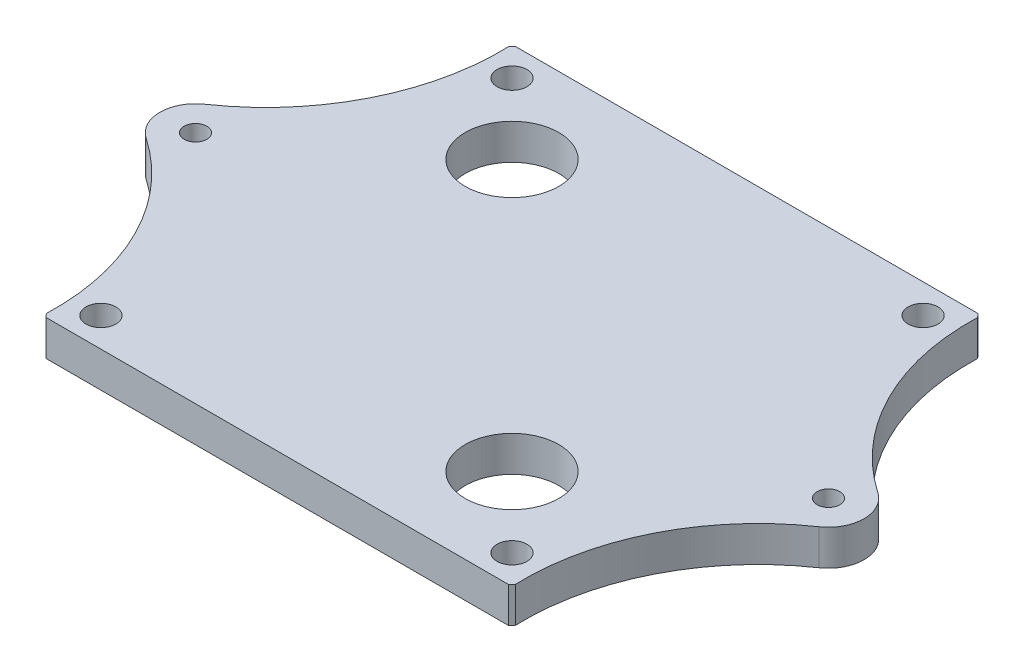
ISO-10303-21;
HEADER;
FILE_DESCRIPTION(('STEP AP214'),'2;1');
FILE_NAME('part.step','',(''),(''),'','','');
FILE_SCHEMA(('AUTOMOTIVE_DESIGN { 1 0 10303 214 1 1 1 1 }'));
ENDSEC;
DATA;
#1=APPLICATION_CONTEXT('core data for automotive mechanical design processes');
#2=APPLICATION_PROTOCOL_DEFINITION('international standard','automotive_design',2000,#1);
#3=PRODUCT_CONTEXT('',#1,'mechanical');
#4=PRODUCT('Part','Part','',(#3));
#5=PRODUCT_RELATED_PRODUCT_CATEGORY('part','',(#4));
#6=PRODUCT_DEFINITION_FORMATION('','',#4);
#7=PRODUCT_DEFINITION_CONTEXT('part definition',#1,'design');
#8=PRODUCT_DEFINITION('design','',#6,#7);
#9=PRODUCT_DEFINITION_SHAPE('','',#8);
#10=(LENGTH_UNIT() NAMED_UNIT(*) SI_UNIT(.MILLI.,.METRE.));
#11=(NAMED_UNIT(*) PLANE_ANGLE_UNIT() SI_UNIT($,.RADIAN.));
#12=(NAMED_UNIT(*) SI_UNIT($,.STERADIAN.) SOLID_ANGLE_UNIT());
#13=UNCERTAINTY_MEASURE_WITH_UNIT(LENGTH_MEASURE(1.E-05),#10,'distance_accuracy_value','');
#14=(GEOMETRIC_REPRESENTATION_CONTEXT(3) GLOBAL_UNCERTAINTY_ASSIGNED_CONTEXT((#13)) GLOBAL_UNIT_ASSIGNED_CONTEXT((#10,
#11,#12)) REPRESENTATION_CONTEXT('',''));
#15=CARTESIAN_POINT('',(0.,0.,0.));
#16=DIRECTION('',(0.,0.,1.));
#17=DIRECTION('',(1.,0.,0.));
#18=AXIS2_PLACEMENT_3D('',#15,#16,#17);
#19=CARTESIAN_POINT('',(-65.959263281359,5.,-31.3608038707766));
#20=DIRECTION('',(0.,-1.,0.));
#21=DIRECTION('',(0.,0.,-1.));
#22=AXIS2_PLACEMENT_3D('',#19,#20,#21);
#23=CYLINDRICAL_SURFACE('',#22,33.);
#24=CARTESIAN_POINT('',(-65.959263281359,5.,-31.3608038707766));
#25=DIRECTION('',(0.,-1.,0.));
#26=DIRECTION('',(0.,0.,1.));
#27=AXIS2_PLACEMENT_3D('',#24,#25,#26);
#28=CIRCLE('',#27,33.);
#29=CARTESIAN_POINT('',(-32.9796417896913,5.,-32.5203582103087));
#30=VERTEX_POINT('',#29);
#31=CARTESIAN_POINT('',(-47.323587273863,5.,-4.12642156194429));
#32=VERTEX_POINT('',#31);
#33=EDGE_CURVE('E237',#30,#32,#28,.T.);
#34=ORIENTED_EDGE('',*,*,#33,.F.);
#35=DIRECTION('',(0.,-1.,0.));
#36=VECTOR('',#35,1.);
#37=CARTESIAN_POINT('',(-32.9796417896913,5.,-32.5203582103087));
#38=LINE('',#37,#36);
#39=CARTESIAN_POINT('',(-32.9796417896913,0.,-32.5203582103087));
#40=VERTEX_POINT('',#39);
#41=EDGE_CURVE('E126',#30,#40,#38,.T.);
#42=ORIENTED_EDGE('',*,*,#41,.T.);
#43=CARTESIAN_POINT('',(-65.959263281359,0.,-31.3608038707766));
#44=DIRECTION('',(0.,-1.,0.));
#45=DIRECTION('',(0.,0.,1.));
#46=AXIS2_PLACEMENT_3D('',#43,#44,#45);
#47=CIRCLE('',#46,33.);
#48=CARTESIAN_POINT('',(-47.323587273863,0.,-4.12642156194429));
#49=VERTEX_POINT('',#48);
#50=EDGE_CURVE('E120',#40,#49,#47,.T.);
#51=ORIENTED_EDGE('',*,*,#50,.T.);
#52=DIRECTION('',(0.,-1.,0.));
#53=VECTOR('',#52,1.);
#54=CARTESIAN_POINT('',(-47.323587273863,5.,-4.12642156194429));
#55=LINE('',#54,#53);
#56=EDGE_CURVE('E124',#32,#49,#55,.T.);
#57=ORIENTED_EDGE('',*,*,#56,.F.);
#58=EDGE_LOOP('',(#34,#42,#51,#57));
#59=FACE_BOUND('',#58,.T.);
#60=ADVANCED_FACE('F27',(#59),#23,.F.);
#61=CARTESIAN_POINT('',(-44.5,5.,0.));
#62=DIRECTION('',(0.,-1.,0.));
#63=DIRECTION('',(0.,0.,-1.));
#64=AXIS2_PLACEMENT_3D('',#61,#62,#63);
#65=CYLINDRICAL_SURFACE('',#64,4.99999999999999);
#66=CARTESIAN_POINT('',(-44.5,0.,0.));
#67=DIRECTION('',(0.,1.,0.));
#68=DIRECTION('',(0.,0.,1.));
#69=AXIS2_PLACEMENT_3D('',#66,#67,#68);
#70=CIRCLE('',#69,4.99999999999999);
#71=CARTESIAN_POINT('',(-47.323587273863,0.,4.1264215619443));
#72=VERTEX_POINT('',#71);
#73=EDGE_CURVE('E128',#49,#72,#70,.T.);
#74=ORIENTED_EDGE('',*,*,#73,.T.);
#75=DIRECTION('',(0.,-1.,0.));
#76=VECTOR('',#75,1.);
#77=CARTESIAN_POINT('',(-47.323587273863,5.,4.1264215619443));
#78=LINE('',#77,#76);
#79=CARTESIAN_POINT('',(-47.323587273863,5.,4.1264215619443));
#80=VERTEX_POINT('',#79);
#81=EDGE_CURVE('E142',#80,#72,#78,.T.);
#82=ORIENTED_EDGE('',*,*,#81,.F.);
#83=CARTESIAN_POINT('',(-44.5,5.,0.));
#84=DIRECTION('',(0.,1.,0.));
#85=DIRECTION('',(0.,0.,1.));
#86=AXIS2_PLACEMENT_3D('',#83,#84,#85);
#87=CIRCLE('',#86,4.99999999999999);
#88=EDGE_CURVE('E141',#32,#80,#87,.T.);
#89=ORIENTED_EDGE('',*,*,#88,.F.);
#90=ORIENTED_EDGE('',*,*,#56,.T.);
#91=EDGE_LOOP('',(#74,#82,#89,#90));
#92=FACE_BOUND('',#91,.T.);
#93=ADVANCED_FACE('F140',(#92),#65,.T.);
#94=CARTESIAN_POINT('',(-65.959263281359,5.,31.3608038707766));
#95=DIRECTION('',(0.,-1.,0.));
#96=DIRECTION('',(0.,0.,-1.));
#97=AXIS2_PLACEMENT_3D('',#94,#95,#96);
#98=CYLINDRICAL_SURFACE('',#97,33.);
#99=CARTESIAN_POINT('',(-65.959263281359,0.,31.3608038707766));
#100=DIRECTION('',(0.,-1.,0.));
#101=DIRECTION('',(0.,0.,1.));
#102=AXIS2_PLACEMENT_3D('',#99,#100,#101);
#103=CIRCLE('',#102,33.);
#104=CARTESIAN_POINT('',(-32.978814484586,0.,32.4965842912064));
#105=VERTEX_POINT('',#104);
#106=EDGE_CURVE('E134',#72,#105,#103,.T.);
#107=ORIENTED_EDGE('',*,*,#106,.T.);
#108=DIRECTION('',(0.,-1.,0.));
#109=VECTOR('',#108,1.);
#110=CARTESIAN_POINT('',(-32.978814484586,5.,32.4965842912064));
#111=LINE('',#110,#109);
#112=CARTESIAN_POINT('',(-32.978814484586,5.,32.4965842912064));
#113=VERTEX_POINT('',#112);
#114=EDGE_CURVE('E11',#105,#113,#111,.F.);
#115=ORIENTED_EDGE('',*,*,#114,.T.);
#116=CARTESIAN_POINT('',(-65.959263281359,5.,31.3608038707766));
#117=DIRECTION('',(0.,-1.,0.));
#118=DIRECTION('',(0.,0.,1.));
#119=AXIS2_PLACEMENT_3D('',#116,#117,#118);
#120=CIRCLE('',#119,33.);
#121=EDGE_CURVE('E240',#80,#113,#120,.T.);
#122=ORIENTED_EDGE('',*,*,#121,.F.);
#123=ORIENTED_EDGE('',*,*,#81,.T.);
#124=EDGE_LOOP('',(#107,#115,#122,#123));
#125=FACE_BOUND('',#124,.T.);
#126=ADVANCED_FACE('F283',(#125),#98,.F.);
#127=CARTESIAN_POINT('',(-33.,5.,33.));
#128=DIRECTION('',(0.,0.,-1.));
#129=DIRECTION('',(-1.,0.,0.));
#130=AXIS2_PLACEMENT_3D('',#127,#128,#129);
#131=PLANE('',#130);
#132=DIRECTION('',(1.,0.,0.));
#133=VECTOR('',#132,1.);
#134=CARTESIAN_POINT('',(-33.,0.,33.));
#135=LINE('',#134,#133);
#136=CARTESIAN_POINT('',(-32.523100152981,0.,33.));
#137=VERTEX_POINT('',#136);
#138=CARTESIAN_POINT('',(32.5,0.,33.));
#139=VERTEX_POINT('',#138);
#140=EDGE_CURVE('E225',#137,#139,#135,.T.);
#141=ORIENTED_EDGE('',*,*,#140,.T.);
#142=DIRECTION('',(0.,1.,0.));
#143=VECTOR('',#142,1.);
#144=CARTESIAN_POINT('',(32.5,5.,33.));
#145=LINE('',#144,#143);
#146=CARTESIAN_POINT('',(32.5,5.,33.));
#147=VERTEX_POINT('',#146);
#148=EDGE_CURVE('E35',#139,#147,#145,.T.);
#149=ORIENTED_EDGE('',*,*,#148,.T.);
#150=DIRECTION('',(1.,0.,0.));
#151=VECTOR('',#150,1.);
#152=CARTESIAN_POINT('',(-33.,5.,33.));
#153=LINE('',#152,#151);
#154=CARTESIAN_POINT('',(-32.523100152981,5.,33.));
#155=VERTEX_POINT('',#154);
#156=EDGE_CURVE('E243',#155,#147,#153,.T.);
#157=ORIENTED_EDGE('',*,*,#156,.F.);
#158=DIRECTION('',(0.,-1.,0.));
#159=VECTOR('',#158,1.);
#160=CARTESIAN_POINT('',(-32.523100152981,5.,33.));
#161=LINE('',#160,#159);
#162=EDGE_CURVE('E173',#155,#137,#161,.T.);
#163=ORIENTED_EDGE('',*,*,#162,.T.);
#164=EDGE_LOOP('',(#141,#149,#157,#163));
#165=FACE_BOUND('',#164,.T.);
#166=ADVANCED_FACE('F290',(#165),#131,.F.);
#167=CARTESIAN_POINT('',(65.959263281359,5.,31.3608038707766));
#168=DIRECTION('',(0.,-1.,0.));
#169=DIRECTION('',(0.,0.,-1.));
#170=AXIS2_PLACEMENT_3D('',#167,#168,#169);
#171=CYLINDRICAL_SURFACE('',#170,33.);
#172=CARTESIAN_POINT('',(65.959263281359,5.,31.3608038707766));
#173=DIRECTION('',(0.,-1.,0.));
#174=DIRECTION('',(0.,0.,-1.));
#175=AXIS2_PLACEMENT_3D('',#172,#173,#174);
#176=CIRCLE('',#175,33.);
#177=CARTESIAN_POINT('',(32.9796417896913,5.,32.5203582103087));
#178=VERTEX_POINT('',#177);
#179=CARTESIAN_POINT('',(47.323587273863,5.,4.12642156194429));
#180=VERTEX_POINT('',#179);
#181=EDGE_CURVE('E245',#178,#180,#176,.T.);
#182=ORIENTED_EDGE('',*,*,#181,.F.);
#183=DIRECTION('',(0.,-1.,0.));
#184=VECTOR('',#183,1.);
#185=CARTESIAN_POINT('',(32.9796417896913,5.,32.5203582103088));
#186=LINE('',#185,#184);
#187=CARTESIAN_POINT('',(32.9796417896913,0.,32.5203582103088));
#188=VERTEX_POINT('',#187);
#189=EDGE_CURVE('E170',#178,#188,#186,.T.);
#190=ORIENTED_EDGE('',*,*,#189,.T.);
#191=CARTESIAN_POINT('',(65.959263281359,0.,31.3608038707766));
#192=DIRECTION('',(0.,-1.,0.));
#193=DIRECTION('',(0.,0.,-1.));
#194=AXIS2_PLACEMENT_3D('',#191,#192,#193);
#195=CIRCLE('',#194,33.);
#196=CARTESIAN_POINT('',(47.323587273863,0.,4.12642156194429));
#197=VERTEX_POINT('',#196);
#198=EDGE_CURVE('E228',#188,#197,#195,.T.);
#199=ORIENTED_EDGE('',*,*,#198,.T.);
#200=DIRECTION('',(0.,-1.,0.));
#201=VECTOR('',#200,1.);
#202=CARTESIAN_POINT('',(47.323587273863,5.,4.12642156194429));
#203=LINE('',#202,#201);
#204=EDGE_CURVE('E146',#180,#197,#203,.T.);
#205=ORIENTED_EDGE('',*,*,#204,.F.);
#206=EDGE_LOOP('',(#182,#190,#199,#205));
#207=FACE_BOUND('',#206,.T.);
#208=ADVANCED_FACE('F296',(#207),#171,.F.);
#209=CARTESIAN_POINT('',(44.5,5.,0.));
#210=DIRECTION('',(0.,-1.,0.));
#211=DIRECTION('',(0.,0.,-1.));
#212=AXIS2_PLACEMENT_3D('',#209,#210,#211);
#213=CYLINDRICAL_SURFACE('',#212,4.99999999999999);
#214=CARTESIAN_POINT('',(44.5,0.,0.));
#215=DIRECTION('',(0.,1.,0.));
#216=DIRECTION('',(0.,0.,-1.));
#217=AXIS2_PLACEMENT_3D('',#214,#215,#216);
#218=CIRCLE('',#217,4.99999999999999);
#219=CARTESIAN_POINT('',(47.323587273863,0.,-4.1264215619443));
#220=VERTEX_POINT('',#219);
#221=EDGE_CURVE('E230',#197,#220,#218,.T.);
#222=ORIENTED_EDGE('',*,*,#221,.T.);
#223=DIRECTION('',(0.,-1.,0.));
#224=VECTOR('',#223,1.);
#225=CARTESIAN_POINT('',(47.323587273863,5.,-4.1264215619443));
#226=LINE('',#225,#224);
#227=CARTESIAN_POINT('',(47.323587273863,5.,-4.1264215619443));
#228=VERTEX_POINT('',#227);
#229=EDGE_CURVE('E254',#228,#220,#226,.T.);
#230=ORIENTED_EDGE('',*,*,#229,.F.);
#231=CARTESIAN_POINT('',(44.5,5.,0.));
#232=DIRECTION('',(0.,1.,0.));
#233=DIRECTION('',(0.,0.,-1.));
#234=AXIS2_PLACEMENT_3D('',#231,#232,#233);
#235=CIRCLE('',#234,4.99999999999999);
#236=EDGE_CURVE('E247',#180,#228,#235,.T.);
#237=ORIENTED_EDGE('',*,*,#236,.F.);
#238=ORIENTED_EDGE('',*,*,#204,.T.);
#239=EDGE_LOOP('',(#222,#230,#237,#238));
#240=FACE_BOUND('',#239,.T.);
#241=ADVANCED_FACE('F261',(#240),#213,.T.);
#242=CARTESIAN_POINT('',(65.959263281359,5.,-31.3608038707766));
#243=DIRECTION('',(0.,-1.,0.));
#244=DIRECTION('',(0.,0.,-1.));
#245=AXIS2_PLACEMENT_3D('',#242,#243,#244);
#246=CYLINDRICAL_SURFACE('',#245,33.);
#247=CARTESIAN_POINT('',(65.959263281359,0.,-31.3608038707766));
#248=DIRECTION('',(0.,-1.,0.));
#249=DIRECTION('',(0.,0.,-1.));
#250=AXIS2_PLACEMENT_3D('',#247,#248,#249);
#251=CIRCLE('',#250,33.);
#252=CARTESIAN_POINT('',(32.978814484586,0.,-32.4965842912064));
#253=VERTEX_POINT('',#252);
#254=EDGE_CURVE('E232',#220,#253,#251,.T.);
#255=ORIENTED_EDGE('',*,*,#254,.T.);
#256=DIRECTION('',(0.,-1.,0.));
#257=VECTOR('',#256,1.);
#258=CARTESIAN_POINT('',(32.978814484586,5.,-32.4965842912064));
#259=LINE('',#258,#257);
#260=CARTESIAN_POINT('',(32.978814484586,5.,-32.4965842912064));
#261=VERTEX_POINT('',#260);
#262=EDGE_CURVE('E43',#253,#261,#259,.F.);
#263=ORIENTED_EDGE('',*,*,#262,.T.);
#264=CARTESIAN_POINT('',(65.959263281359,5.,-31.3608038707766));
#265=DIRECTION('',(0.,-1.,0.));
#266=DIRECTION('',(0.,0.,-1.));
#267=AXIS2_PLACEMENT_3D('',#264,#265,#266);
#268=CIRCLE('',#267,33.);
#269=EDGE_CURVE('E249',#228,#261,#268,.T.);
#270=ORIENTED_EDGE('',*,*,#269,.F.);
#271=ORIENTED_EDGE('',*,*,#229,.T.);
#272=EDGE_LOOP('',(#255,#263,#270,#271));
#273=FACE_BOUND('',#272,.T.);
#274=ADVANCED_FACE('F267',(#273),#246,.F.);
#275=CARTESIAN_POINT('',(-33.,5.,-33.));
#276=DIRECTION('',(0.,0.,1.));
#277=DIRECTION('',(1.,0.,0.));
#278=AXIS2_PLACEMENT_3D('',#275,#276,#277);
#279=PLANE('',#278);
#280=DIRECTION('',(-1.,0.,0.));
#281=VECTOR('',#280,1.);
#282=CARTESIAN_POINT('',(-33.,0.,-33.));
#283=LINE('',#282,#281);
#284=CARTESIAN_POINT('',(32.523100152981,0.,-33.));
#285=VERTEX_POINT('',#284);
#286=CARTESIAN_POINT('',(-32.5,0.,-33.));
#287=VERTEX_POINT('',#286);
#288=EDGE_CURVE('E234',#285,#287,#283,.T.);
#289=ORIENTED_EDGE('',*,*,#288,.T.);
#290=DIRECTION('',(0.,1.,0.));
#291=VECTOR('',#290,1.);
#292=CARTESIAN_POINT('',(-32.5,5.,-33.));
#293=LINE('',#292,#291);
#294=CARTESIAN_POINT('',(-32.5,5.,-33.));
#295=VERTEX_POINT('',#294);
#296=EDGE_CURVE('E160',#287,#295,#293,.T.);
#297=ORIENTED_EDGE('',*,*,#296,.T.);
#298=DIRECTION('',(-1.,0.,0.));
#299=VECTOR('',#298,1.);
#300=CARTESIAN_POINT('',(-33.,5.,-33.));
#301=LINE('',#300,#299);
#302=CARTESIAN_POINT('',(32.523100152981,5.,-33.));
#303=VERTEX_POINT('',#302);
#304=EDGE_CURVE('E251',#303,#295,#301,.T.);
#305=ORIENTED_EDGE('',*,*,#304,.F.);
#306=DIRECTION('',(0.,-1.,0.));
#307=VECTOR('',#306,1.);
#308=CARTESIAN_POINT('',(32.523100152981,5.,-33.));
#309=LINE('',#308,#307);
#310=EDGE_CURVE('E157',#303,#285,#309,.T.);
#311=ORIENTED_EDGE('',*,*,#310,.T.);
#312=EDGE_LOOP('',(#289,#297,#305,#311));
#313=FACE_BOUND('',#312,.T.);
#314=ADVANCED_FACE('F276',(#313),#279,.F.);
#315=CARTESIAN_POINT('',(-65.959263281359,5.,-31.3608038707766));
#316=DIRECTION('',(0.,1.,0.));
#317=DIRECTION('',(0.,0.,1.));
#318=AXIS2_PLACEMENT_3D('',#315,#316,#317);
#319=PLANE('',#318);
#320=CARTESIAN_POINT('',(19.,5.,19.));
#321=DIRECTION('',(0.,1.,0.));
#322=DIRECTION('',(0.,0.,1.));
#323=AXIS2_PLACEMENT_3D('',#320,#321,#322);
#324=CIRCLE('',#323,6.57849999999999);
#325=CARTESIAN_POINT('',(19.,5.,25.5785));
#326=VERTEX_POINT('',#325);
#327=EDGE_CURVE('E190',#326,#326,#324,.T.);
#328=ORIENTED_EDGE('',*,*,#327,.F.);
#329=EDGE_LOOP('',(#328));
#330=FACE_BOUND('',#329,.T.);
#331=CARTESIAN_POINT('',(-19.,5.,-19.));
#332=DIRECTION('',(0.,1.,0.));
#333=DIRECTION('',(0.,0.,1.));
#334=AXIS2_PLACEMENT_3D('',#331,#332,#333);
#335=CIRCLE('',#334,6.57849999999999);
#336=CARTESIAN_POINT('',(-19.,5.,-12.4215));
#337=VERTEX_POINT('',#336);
#338=EDGE_CURVE('E179',#337,#337,#335,.T.);
#339=ORIENTED_EDGE('',*,*,#338,.F.);
#340=EDGE_LOOP('',(#339));
#341=FACE_BOUND('',#340,.T.);
#342=CARTESIAN_POINT('',(-28.9,5.,28.9));
#343=DIRECTION('',(0.,1.,0.));
#344=DIRECTION('',(0.,0.,1.));
#345=AXIS2_PLACEMENT_3D('',#342,#343,#344);
#346=CIRCLE('',#345,2.1);
#347=CARTESIAN_POINT('',(-28.9,5.,31.));
#348=VERTEX_POINT('',#347);
#349=EDGE_CURVE('E178',#348,#348,#346,.T.);
#350=ORIENTED_EDGE('',*,*,#349,.F.);
#351=EDGE_LOOP('',(#350));
#352=FACE_BOUND('',#351,.T.);
#353=CARTESIAN_POINT('',(28.9,5.,28.9));
#354=DIRECTION('',(0.,1.,0.));
#355=DIRECTION('',(0.,0.,1.));
#356=AXIS2_PLACEMENT_3D('',#353,#354,#355);
#357=CIRCLE('',#356,2.1);
#358=CARTESIAN_POINT('',(28.9,5.,31.));
#359=VERTEX_POINT('',#358);
#360=EDGE_CURVE('E195',#359,#359,#357,.T.);
#361=ORIENTED_EDGE('',*,*,#360,.F.);
#362=EDGE_LOOP('',(#361));
#363=FACE_BOUND('',#362,.T.);
#364=CARTESIAN_POINT('',(28.9,5.,-28.9));
#365=DIRECTION('',(0.,1.,0.));
#366=DIRECTION('',(0.,0.,1.));
#367=AXIS2_PLACEMENT_3D('',#364,#365,#366);
#368=CIRCLE('',#367,2.1);
#369=CARTESIAN_POINT('',(28.9,5.,-26.8));
#370=VERTEX_POINT('',#369);
#371=EDGE_CURVE('E201',#370,#370,#368,.T.);
#372=ORIENTED_EDGE('',*,*,#371,.F.);
#373=EDGE_LOOP('',(#372));
#374=FACE_BOUND('',#373,.T.);
#375=CARTESIAN_POINT('',(-28.9,5.,-28.9));
#376=DIRECTION('',(0.,1.,0.));
#377=DIRECTION('',(0.,0.,1.));
#378=AXIS2_PLACEMENT_3D('',#375,#376,#377);
#379=CIRCLE('',#378,2.1);
#380=CARTESIAN_POINT('',(-28.9,5.,-26.8));
#381=VERTEX_POINT('',#380);
#382=EDGE_CURVE('E207',#381,#381,#379,.T.);
#383=ORIENTED_EDGE('',*,*,#382,.F.);
#384=EDGE_LOOP('',(#383));
#385=FACE_BOUND('',#384,.T.);
#386=CARTESIAN_POINT('',(44.5,5.,0.));
#387=DIRECTION('',(0.,1.,0.));
#388=DIRECTION('',(0.,0.,1.));
#389=AXIS2_PLACEMENT_3D('',#386,#387,#388);
#390=CIRCLE('',#389,1.6);
#391=CARTESIAN_POINT('',(44.5,5.,1.6));
#392=VERTEX_POINT('',#391);
#393=EDGE_CURVE('E213',#392,#392,#390,.T.);
#394=ORIENTED_EDGE('',*,*,#393,.F.);
#395=EDGE_LOOP('',(#394));
#396=FACE_BOUND('',#395,.T.);
#397=CARTESIAN_POINT('',(-44.5,5.,0.));
#398=DIRECTION('',(0.,1.,0.));
#399=DIRECTION('',(0.,0.,1.));
#400=AXIS2_PLACEMENT_3D('',#397,#398,#399);
#401=CIRCLE('',#400,1.6);
#402=CARTESIAN_POINT('',(-44.5,5.,1.6));
#403=VERTEX_POINT('',#402);
#404=EDGE_CURVE('E219',#403,#403,#401,.T.);
#405=ORIENTED_EDGE('',*,*,#404,.F.);
#406=EDGE_LOOP('',(#405));
#407=FACE_BOUND('',#406,.T.);
#408=ORIENTED_EDGE('',*,*,#304,.T.);
#409=DIRECTION('',(0.707106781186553,0.,-0.707106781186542));
#410=VECTOR('',#409,1.);
#411=CARTESIAN_POINT('',(-50.0492297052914,5.,-15.4507702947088));
#412=LINE('',#411,#410);
#413=EDGE_CURVE('E167',#295,#30,#412,.F.);
#414=ORIENTED_EDGE('',*,*,#413,.T.);
#415=ORIENTED_EDGE('',*,*,#33,.T.);
#416=ORIENTED_EDGE('',*,*,#88,.T.);
#417=ORIENTED_EDGE('',*,*,#121,.T.);
#418=DIRECTION('',(-0.671110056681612,0.,-0.741357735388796));
#419=VECTOR('',#418,1.);
#420=CARTESIAN_POINT('',(-79.6039706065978,5.,-19.009006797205));
#421=LINE('',#420,#419);
#422=EDGE_CURVE('E162',#113,#155,#421,.F.);
#423=ORIENTED_EDGE('',*,*,#422,.T.);
#424=ORIENTED_EDGE('',*,*,#156,.T.);
#425=DIRECTION('',(-0.707106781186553,0.,0.707106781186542));
#426=VECTOR('',#425,1.);
#427=CARTESIAN_POINT('',(15.4507702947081,5.,50.0492297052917));
#428=LINE('',#427,#426);
#429=EDGE_CURVE('E51',#147,#178,#428,.F.);
#430=ORIENTED_EDGE('',*,*,#429,.T.);
#431=ORIENTED_EDGE('',*,*,#181,.T.);
#432=ORIENTED_EDGE('',*,*,#236,.T.);
#433=ORIENTED_EDGE('',*,*,#269,.T.);
#434=DIRECTION('',(0.671110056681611,0.,0.741357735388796));
#435=VECTOR('',#434,1.);
#436=CARTESIAN_POINT('',(-11.0166907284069,5.,-81.0972687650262));
#437=LINE('',#436,#435);
#438=EDGE_CURVE('E165',#261,#303,#437,.F.);
#439=ORIENTED_EDGE('',*,*,#438,.T.);
#440=EDGE_LOOP('',(#408,#414,#415,#416,#417,#423,#424,#430,#431,#432,#433,#439));
#441=FACE_BOUND('',#440,.T.);
#442=ADVANCED_FACE('F273',(#330,#341,#352,#363,#374,#385,#396,#407,#441),#319,.T.);
#443=CARTESIAN_POINT('',(-65.959263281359,0.,-31.3608038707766));
#444=DIRECTION('',(0.,1.,0.));
#445=DIRECTION('',(0.,0.,1.));
#446=AXIS2_PLACEMENT_3D('',#443,#444,#445);
#447=PLANE('',#446);
#448=CARTESIAN_POINT('',(19.,0.,19.));
#449=DIRECTION('',(0.,1.,0.));
#450=DIRECTION('',(0.,0.,1.));
#451=AXIS2_PLACEMENT_3D('',#448,#449,#450);
#452=CIRCLE('',#451,6.57849999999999);
#453=CARTESIAN_POINT('',(19.,0.,25.5785));
#454=VERTEX_POINT('',#453);
#455=EDGE_CURVE('E30',#454,#454,#452,.T.);
#456=ORIENTED_EDGE('',*,*,#455,.T.);
#457=EDGE_LOOP('',(#456));
#458=FACE_BOUND('',#457,.T.);
#459=CARTESIAN_POINT('',(-19.,0.,-19.));
#460=DIRECTION('',(0.,1.,0.));
#461=DIRECTION('',(0.,0.,1.));
#462=AXIS2_PLACEMENT_3D('',#459,#460,#461);
#463=CIRCLE('',#462,6.57849999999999);
#464=CARTESIAN_POINT('',(-19.,0.,-12.4215));
#465=VERTEX_POINT('',#464);
#466=EDGE_CURVE('E176',#465,#465,#463,.T.);
#467=ORIENTED_EDGE('',*,*,#466,.T.);
#468=EDGE_LOOP('',(#467));
#469=FACE_BOUND('',#468,.T.);
#470=CARTESIAN_POINT('',(-28.9,0.,28.9));
#471=DIRECTION('',(0.,1.,0.));
#472=DIRECTION('',(0.,0.,1.));
#473=AXIS2_PLACEMENT_3D('',#470,#471,#472);
#474=CIRCLE('',#473,2.1);
#475=CARTESIAN_POINT('',(-28.9,0.,31.));
#476=VERTEX_POINT('',#475);
#477=EDGE_CURVE('E183',#476,#476,#474,.T.);
#478=ORIENTED_EDGE('',*,*,#477,.T.);
#479=EDGE_LOOP('',(#478));
#480=FACE_BOUND('',#479,.T.);
#481=CARTESIAN_POINT('',(28.9,0.,28.9));
#482=DIRECTION('',(0.,1.,0.));
#483=DIRECTION('',(0.,0.,1.));
#484=AXIS2_PLACEMENT_3D('',#481,#482,#483);
#485=CIRCLE('',#484,2.1);
#486=CARTESIAN_POINT('',(28.9,0.,31.));
#487=VERTEX_POINT('',#486);
#488=EDGE_CURVE('E198',#487,#487,#485,.T.);
#489=ORIENTED_EDGE('',*,*,#488,.T.);
#490=EDGE_LOOP('',(#489));
#491=FACE_BOUND('',#490,.T.);
#492=CARTESIAN_POINT('',(28.9,0.,-28.9));
#493=DIRECTION('',(0.,1.,0.));
#494=DIRECTION('',(0.,0.,1.));
#495=AXIS2_PLACEMENT_3D('',#492,#493,#494);
#496=CIRCLE('',#495,2.1);
#497=CARTESIAN_POINT('',(28.9,0.,-26.8));
#498=VERTEX_POINT('',#497);
#499=EDGE_CURVE('E204',#498,#498,#496,.T.);
#500=ORIENTED_EDGE('',*,*,#499,.T.);
#501=EDGE_LOOP('',(#500));
#502=FACE_BOUND('',#501,.T.);
#503=CARTESIAN_POINT('',(-28.9,0.,-28.9));
#504=DIRECTION('',(0.,1.,0.));
#505=DIRECTION('',(0.,0.,1.));
#506=AXIS2_PLACEMENT_3D('',#503,#504,#505);
#507=CIRCLE('',#506,2.1);
#508=CARTESIAN_POINT('',(-28.9,0.,-26.8));
#509=VERTEX_POINT('',#508);
#510=EDGE_CURVE('E210',#509,#509,#507,.T.);
#511=ORIENTED_EDGE('',*,*,#510,.T.);
#512=EDGE_LOOP('',(#511));
#513=FACE_BOUND('',#512,.T.);
#514=CARTESIAN_POINT('',(44.5,0.,0.));
#515=DIRECTION('',(0.,1.,0.));
#516=DIRECTION('',(0.,0.,1.));
#517=AXIS2_PLACEMENT_3D('',#514,#515,#516);
#518=CIRCLE('',#517,1.6);
#519=CARTESIAN_POINT('',(44.5,0.,1.6));
#520=VERTEX_POINT('',#519);
#521=EDGE_CURVE('E216',#520,#520,#518,.T.);
#522=ORIENTED_EDGE('',*,*,#521,.T.);
#523=EDGE_LOOP('',(#522));
#524=FACE_BOUND('',#523,.T.);
#525=CARTESIAN_POINT('',(-44.5,0.,0.));
#526=DIRECTION('',(0.,1.,0.));
#527=DIRECTION('',(0.,0.,1.));
#528=AXIS2_PLACEMENT_3D('',#525,#526,#527);
#529=CIRCLE('',#528,1.6);
#530=CARTESIAN_POINT('',(-44.5,0.,1.6));
#531=VERTEX_POINT('',#530);
#532=EDGE_CURVE('E129',#531,#531,#529,.T.);
#533=ORIENTED_EDGE('',*,*,#532,.T.);
#534=EDGE_LOOP('',(#533));
#535=FACE_BOUND('',#534,.T.);
#536=ORIENTED_EDGE('',*,*,#50,.F.);
#537=DIRECTION('',(-0.707106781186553,0.,0.707106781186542));
#538=VECTOR('',#537,1.);
#539=CARTESIAN_POINT('',(-32.9796417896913,0.,-32.5203582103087));
#540=LINE('',#539,#538);
#541=EDGE_CURVE('E155',#40,#287,#540,.F.);
#542=ORIENTED_EDGE('',*,*,#541,.T.);
#543=ORIENTED_EDGE('',*,*,#288,.F.);
#544=DIRECTION('',(-0.671110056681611,0.,-0.741357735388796));
#545=VECTOR('',#544,1.);
#546=CARTESIAN_POINT('',(32.523100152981,0.,-33.));
#547=LINE('',#546,#545);
#548=EDGE_CURVE('E153',#285,#253,#547,.F.);
#549=ORIENTED_EDGE('',*,*,#548,.T.);
#550=ORIENTED_EDGE('',*,*,#254,.F.);
#551=ORIENTED_EDGE('',*,*,#221,.F.);
#552=ORIENTED_EDGE('',*,*,#198,.F.);
#553=DIRECTION('',(0.707106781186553,0.,-0.707106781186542));
#554=VECTOR('',#553,1.);
#555=CARTESIAN_POINT('',(32.9796417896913,0.,32.5203582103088));
#556=LINE('',#555,#554);
#557=EDGE_CURVE('E151',#188,#139,#556,.F.);
#558=ORIENTED_EDGE('',*,*,#557,.T.);
#559=ORIENTED_EDGE('',*,*,#140,.F.);
#560=DIRECTION('',(0.671110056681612,0.,0.741357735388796));
#561=VECTOR('',#560,1.);
#562=CARTESIAN_POINT('',(-32.523100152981,0.,33.));
#563=LINE('',#562,#561);
#564=EDGE_CURVE('E144',#137,#105,#563,.F.);
#565=ORIENTED_EDGE('',*,*,#564,.T.);
#566=ORIENTED_EDGE('',*,*,#106,.F.);
#567=ORIENTED_EDGE('',*,*,#73,.F.);
#568=EDGE_LOOP('',(#536,#542,#543,#549,#550,#551,#552,#558,#559,#565,#566,#567));
#569=FACE_BOUND('',#568,.T.);
#570=ADVANCED_FACE('F132',(#458,#469,#480,#491,#502,#513,#524,#535,#569),#447,.F.);
#571=CARTESIAN_POINT('',(-44.5,0.,0.));
#572=DIRECTION('',(0.,1.,0.));
#573=DIRECTION('',(0.,0.,1.));
#574=AXIS2_PLACEMENT_3D('',#571,#572,#573);
#575=CYLINDRICAL_SURFACE('',#574,1.6);
#576=ORIENTED_EDGE('',*,*,#532,.F.);
#577=EDGE_LOOP('',(#576));
#578=FACE_BOUND('',#577,.T.);
#579=ORIENTED_EDGE('',*,*,#404,.T.);
#580=EDGE_LOOP('',(#579));
#581=FACE_BOUND('',#580,.T.);
#582=ADVANCED_FACE('F355',(#578,#581),#575,.F.);
#583=CARTESIAN_POINT('',(44.5,0.,0.));
#584=DIRECTION('',(0.,1.,0.));
#585=DIRECTION('',(0.,0.,1.));
#586=AXIS2_PLACEMENT_3D('',#583,#584,#585);
#587=CYLINDRICAL_SURFACE('',#586,1.6);
#588=ORIENTED_EDGE('',*,*,#521,.F.);
#589=EDGE_LOOP('',(#588));
#590=FACE_BOUND('',#589,.T.);
#591=ORIENTED_EDGE('',*,*,#393,.T.);
#592=EDGE_LOOP('',(#591));
#593=FACE_BOUND('',#592,.T.);
#594=ADVANCED_FACE('F363',(#590,#593),#587,.F.);
#595=CARTESIAN_POINT('',(-28.9,0.,-28.9));
#596=DIRECTION('',(0.,1.,0.));
#597=DIRECTION('',(0.,0.,1.));
#598=AXIS2_PLACEMENT_3D('',#595,#596,#597);
#599=CYLINDRICAL_SURFACE('',#598,2.1);
#600=ORIENTED_EDGE('',*,*,#510,.F.);
#601=EDGE_LOOP('',(#600));
#602=FACE_BOUND('',#601,.T.);
#603=ORIENTED_EDGE('',*,*,#382,.T.);
#604=EDGE_LOOP('',(#603));
#605=FACE_BOUND('',#604,.T.);
#606=ADVANCED_FACE('F371',(#602,#605),#599,.F.);
#607=CARTESIAN_POINT('',(28.9,0.,-28.9));
#608=DIRECTION('',(0.,1.,0.));
#609=DIRECTION('',(0.,0.,1.));
#610=AXIS2_PLACEMENT_3D('',#607,#608,#609);
#611=CYLINDRICAL_SURFACE('',#610,2.1);
#612=ORIENTED_EDGE('',*,*,#499,.F.);
#613=EDGE_LOOP('',(#612));
#614=FACE_BOUND('',#613,.T.);
#615=ORIENTED_EDGE('',*,*,#371,.T.);
#616=EDGE_LOOP('',(#615));
#617=FACE_BOUND('',#616,.T.);
#618=ADVANCED_FACE('F379',(#614,#617),#611,.F.);
#619=CARTESIAN_POINT('',(28.9,0.,28.9));
#620=DIRECTION('',(0.,1.,0.));
#621=DIRECTION('',(0.,0.,1.));
#622=AXIS2_PLACEMENT_3D('',#619,#620,#621);
#623=CYLINDRICAL_SURFACE('',#622,2.1);
#624=ORIENTED_EDGE('',*,*,#488,.F.);
#625=EDGE_LOOP('',(#624));
#626=FACE_BOUND('',#625,.T.);
#627=ORIENTED_EDGE('',*,*,#360,.T.);
#628=EDGE_LOOP('',(#627));
#629=FACE_BOUND('',#628,.T.);
#630=ADVANCED_FACE('F387',(#626,#629),#623,.F.);
#631=CARTESIAN_POINT('',(-28.9,0.,28.9));
#632=DIRECTION('',(0.,1.,0.));
#633=DIRECTION('',(0.,0.,1.));
#634=AXIS2_PLACEMENT_3D('',#631,#632,#633);
#635=CYLINDRICAL_SURFACE('',#634,2.1);
#636=ORIENTED_EDGE('',*,*,#477,.F.);
#637=EDGE_LOOP('',(#636));
#638=FACE_BOUND('',#637,.T.);
#639=ORIENTED_EDGE('',*,*,#349,.T.);
#640=EDGE_LOOP('',(#639));
#641=FACE_BOUND('',#640,.T.);
#642=ADVANCED_FACE('F395',(#638,#641),#635,.F.);
#643=CARTESIAN_POINT('',(-32.9796417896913,5.,-32.5203582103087));
#644=DIRECTION('',(0.707106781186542,0.,0.707106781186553));
#645=DIRECTION('',(0.707106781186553,0.,-0.707106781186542));
#646=AXIS2_PLACEMENT_3D('',#643,#644,#645);
#647=PLANE('',#646);
#648=ORIENTED_EDGE('',*,*,#413,.F.);
#649=ORIENTED_EDGE('',*,*,#296,.F.);
#650=ORIENTED_EDGE('',*,*,#541,.F.);
#651=ORIENTED_EDGE('',*,*,#41,.F.);
#652=EDGE_LOOP('',(#648,#649,#650,#651));
#653=FACE_BOUND('',#652,.T.);
#654=ADVANCED_FACE('F279',(#653),#647,.F.);
#655=CARTESIAN_POINT('',(32.523100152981,5.,-33.));
#656=DIRECTION('',(-0.741357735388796,0.,0.671110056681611));
#657=DIRECTION('',(0.671110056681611,0.,0.741357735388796));
#658=AXIS2_PLACEMENT_3D('',#655,#656,#657);
#659=PLANE('',#658);
#660=ORIENTED_EDGE('',*,*,#438,.F.);
#661=ORIENTED_EDGE('',*,*,#262,.F.);
#662=ORIENTED_EDGE('',*,*,#548,.F.);
#663=ORIENTED_EDGE('',*,*,#310,.F.);
#664=EDGE_LOOP('',(#660,#661,#662,#663));
#665=FACE_BOUND('',#664,.T.);
#666=ADVANCED_FACE('F270',(#665),#659,.F.);
#667=CARTESIAN_POINT('',(32.9796417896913,5.,32.5203582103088));
#668=DIRECTION('',(-0.707106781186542,0.,-0.707106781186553));
#669=DIRECTION('',(-0.707106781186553,0.,0.707106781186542));
#670=AXIS2_PLACEMENT_3D('',#667,#668,#669);
#671=PLANE('',#670);
#672=ORIENTED_EDGE('',*,*,#429,.F.);
#673=ORIENTED_EDGE('',*,*,#148,.F.);
#674=ORIENTED_EDGE('',*,*,#557,.F.);
#675=ORIENTED_EDGE('',*,*,#189,.F.);
#676=EDGE_LOOP('',(#672,#673,#674,#675));
#677=FACE_BOUND('',#676,.T.);
#678=ADVANCED_FACE('F294',(#677),#671,.F.);
#679=CARTESIAN_POINT('',(-32.523100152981,5.,33.));
#680=DIRECTION('',(0.741357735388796,0.,-0.671110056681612));
#681=DIRECTION('',(-0.671110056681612,0.,-0.741357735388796));
#682=AXIS2_PLACEMENT_3D('',#679,#680,#681);
#683=PLANE('',#682);
#684=ORIENTED_EDGE('',*,*,#422,.F.);
#685=ORIENTED_EDGE('',*,*,#114,.F.);
#686=ORIENTED_EDGE('',*,*,#564,.F.);
#687=ORIENTED_EDGE('',*,*,#162,.F.);
#688=EDGE_LOOP('',(#684,#685,#686,#687));
#689=FACE_BOUND('',#688,.T.);
#690=ADVANCED_FACE('F286',(#689),#683,.F.);
#691=CARTESIAN_POINT('',(-19.,5.,-19.));
#692=DIRECTION('',(0.,1.,0.));
#693=DIRECTION('',(0.,0.,1.));
#694=AXIS2_PLACEMENT_3D('',#691,#692,#693);
#695=CYLINDRICAL_SURFACE('',#694,6.57849999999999);
#696=ORIENTED_EDGE('',*,*,#338,.T.);
#697=EDGE_LOOP('',(#696));
#698=FACE_BOUND('',#697,.T.);
#699=ORIENTED_EDGE('',*,*,#466,.F.);
#700=EDGE_LOOP('',(#699));
#701=FACE_BOUND('',#700,.T.);
#702=ADVANCED_FACE('F425',(#698,#701),#695,.F.);
#703=CARTESIAN_POINT('',(19.,5.,19.));
#704=DIRECTION('',(0.,1.,0.));
#705=DIRECTION('',(0.,0.,1.));
#706=AXIS2_PLACEMENT_3D('',#703,#704,#705);
#707=CYLINDRICAL_SURFACE('',#706,6.57849999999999);
#708=ORIENTED_EDGE('',*,*,#327,.T.);
#709=EDGE_LOOP('',(#708));
#710=FACE_BOUND('',#709,.T.);
#711=ORIENTED_EDGE('',*,*,#455,.F.);
#712=EDGE_LOOP('',(#711));
#713=FACE_BOUND('',#712,.T.);
#714=ADVANCED_FACE('F431',(#710,#713),#707,.F.);
#715=CLOSED_SHELL('',(#60,#93,#126,#166,#208,#241,#274,#314,#442,#570,#582,#594,#606,#618,#630,
#642,#654,#666,#678,#690,#702,#714));
#716=MANIFOLD_SOLID_BREP('B2',#715);
#717=ADVANCED_BREP_SHAPE_REPRESENTATION('',(#18,#716),#14);
#718=SHAPE_DEFINITION_REPRESENTATION(#9,#717);
ENDSEC;
END-ISO-10303-21;
